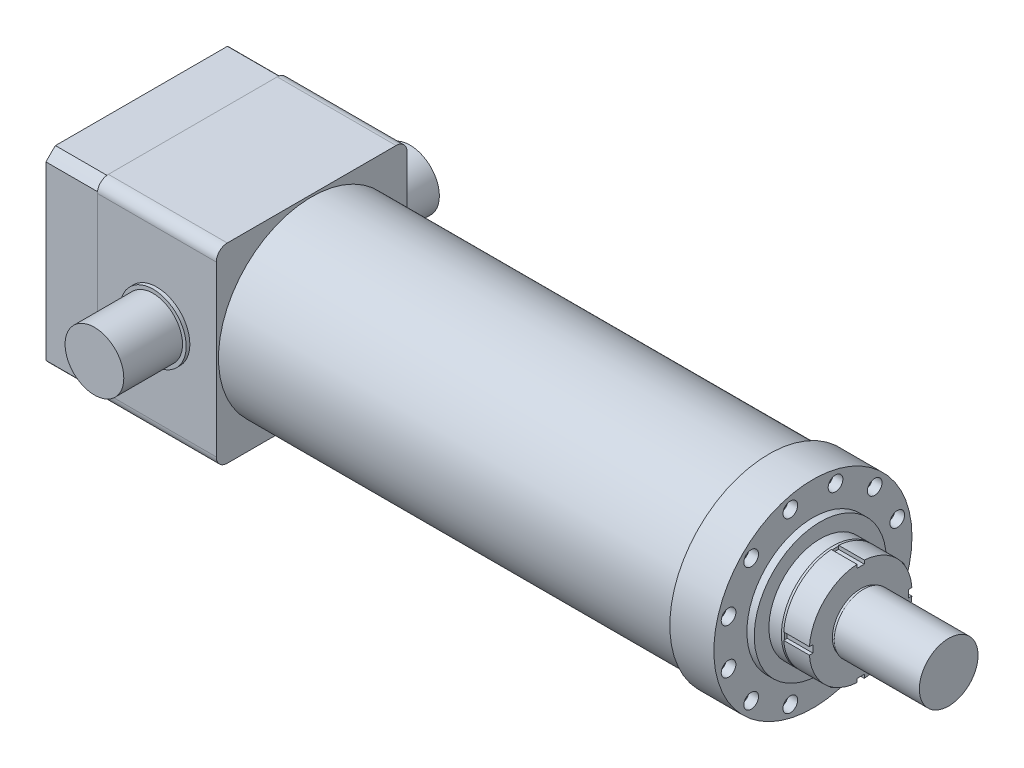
from build123d import *

# Parameters (mm, degrees)
SKETCH_1_R                = 127
SKETCH_1_R_2              = 110
EXTRUDE_1_DEPTH           = 623
SKETCH_2_R                = 135
SKETCH_2_R_2              = 6.5
EXTRUDE_2_DEPTH           = 60
SKETCH_3_R                = 90
EXTRUDE_3_DEPTH           = 10
SKETCH_5_R                = 70
EXTRUDE_4_DEPTH           = 20
CHAMFER_1_SIZE            = 3
CHAMFER_1_SIZE2           = 1.091910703
SKETCH_7_R                = 70
EXTRUDE_5_DEPTH           = 35
SKETCH_8_R                = 38.5
EXTRUDE_6_DEPTH           = 4
SKETCH_9_R                = 40
EXTRUDE_7_DEPTH           = 116
SKETCH_10_W               = 10
SKETCH_10_H               = 12.219318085
SKETCH_10_W_2             = 33.965202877
SKETCH_10_H_2             = 10
SKETCH_10_H_3             = 35.687535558
CUT_EXTRUDE_2_DEPTH       = 35
EXTRUDE_8_DEPTH           = 162
EXTRUDE_10_DEPTH          = 70
SKETCH_16_R               = 80
CUT_EXTRUDE_4_DEPTH       = 26
SKETCH_17_R               = 81.5
CUT_EXTRUDE_5_DEPTH       = 38
SKETCH_22_W               = 10
SKETCH_22_H               = 13
HOLE_WIZARD_1_AT_2_COUNT  = 2
HOLE_WIZARD_1_AT_2_PITCH  = 61.598932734
HOLE_WIZARD_1_AT_3_COUNT  = 2
HOLE_WIZARD_1_AT_3_PITCH  = 119
HOLE_WIZARD_1_AT_4_COUNT  = 2
HOLE_WIZARD_1_AT_4_PITCH  = 168.291413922
HOLE_WIZARD_1_AT_5_COUNT  = 2
HOLE_WIZARD_1_AT_5_PITCH  = 206.114046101
HOLE_WIZARD_1_AT_6_COUNT  = 2
HOLE_WIZARD_1_AT_6_PITCH  = 229.890346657
HOLE_WIZARD_1_AT_7_COUNT  = 2
HOLE_WIZARD_1_AT_7_PITCH  = 238
HOLE_WIZARD_1_AT_8_COUNT  = 2
HOLE_WIZARD_1_AT_8_PITCH  = 229.890346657
HOLE_WIZARD_1_AT_9_COUNT  = 2
HOLE_WIZARD_1_AT_9_PITCH  = 206.114046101
HOLE_WIZARD_1_AT_10_COUNT = 2
HOLE_WIZARD_1_AT_10_PITCH = 168.291413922
HOLE_WIZARD_1_AT_11_COUNT = 2
HOLE_WIZARD_1_AT_11_PITCH = 119
HOLE_WIZARD_1_AT_12_COUNT = 2
HOLE_WIZARD_1_AT_12_PITCH = 61.598932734
SKETCH_24_R               = 40
EXTRUDE_11_DEPTH          = 85
EXTRUDE_START             = -260
SKETCH_24_2_R             = 40
EXTRUDE_12_DEPTH          = 85
SKETCH_25_R               = 45
SKETCH_25_R_2             = 40
EXTRUDE_13_DEPTH          = 5
SKETCH_25_2_R             = 45
SKETCH_25_2_R_2           = 40
EXTRUDE_14_DEPTH          = 5


with BuildPart() as part:
    # Sketch 1 → Extrude 1 (new body)
    with BuildSketch(Plane(origin=(0, 0, 0), x_dir=(0, 0, -1), z_dir=(1, 0, 0))):
        Circle(SKETCH_1_R)
        Circle(SKETCH_1_R_2, mode=Mode.SUBTRACT)
    extrude(amount=EXTRUDE_1_DEPTH)


with BuildPart() as body_2:
    # Sketch 2 → Extrude 2 (new body)
    with BuildSketch(Plane(origin=(623, 0, 0), x_dir=(0, 0, -1), z_dir=(1, 0, 0))):
        Circle(SKETCH_2_R)
        with Locations((30.799466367, 114.945173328)):
            Circle(SKETCH_2_R_2, mode=Mode.SUBTRACT)
        with Locations((84.145706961, 84.145706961)):
            Circle(SKETCH_2_R_2, mode=Mode.SUBTRACT)
        with Locations((114.945173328, 30.799466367)):
            Circle(SKETCH_2_R_2, mode=Mode.SUBTRACT)
        with Locations((114.945173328, -30.799466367)):
            Circle(SKETCH_2_R_2, mode=Mode.SUBTRACT)
        with Locations((84.145706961, -84.145706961)):
            Circle(SKETCH_2_R_2, mode=Mode.SUBTRACT)
        with Locations((30.799466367, -114.945173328)):
            Circle(SKETCH_2_R_2, mode=Mode.SUBTRACT)
        with Locations((-30.799466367, -114.945173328)):
            Circle(SKETCH_2_R_2, mode=Mode.SUBTRACT)
        with Locations((-84.145706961, -84.145706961)):
            Circle(SKETCH_2_R_2, mode=Mode.SUBTRACT)
        with Locations((-114.945173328, -30.799466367)):
            Circle(SKETCH_2_R_2, mode=Mode.SUBTRACT)
        with Locations((-114.945173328, 30.799466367)):
            Circle(SKETCH_2_R_2, mode=Mode.SUBTRACT)
        with Locations((-84.145706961, 84.145706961)):
            Circle(SKETCH_2_R_2, mode=Mode.SUBTRACT)
        with Locations((-30.799466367, 114.945173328)):
            Circle(SKETCH_2_R_2, mode=Mode.SUBTRACT)
    extrude(amount=EXTRUDE_2_DEPTH)

    # Sketch 3 → Extrude 3 (add)
    with BuildSketch(Plane(origin=(683, 0, 0), x_dir=(0, 0, -1), z_dir=(1, 0, 0))):
        Circle(SKETCH_3_R)
    extrude(amount=EXTRUDE_3_DEPTH)

    # Sketch 5 → Extrude 4 (add)
    with BuildSketch(Plane(origin=(693, 0, 0), x_dir=(0, 0, -1), z_dir=(1, 0, 0))):
        Circle(SKETCH_5_R)
    extrude(amount=EXTRUDE_4_DEPTH)

    # Chamfer 1
    chamfer_1_edges = [body_2.edges().sort_by_distance(p)[0] for p in [
        (713, 0, 70),
    ]]
    chamfer_1_side = [body_2.faces().sort_by_distance(p)[0] for p in [
        (703, 0, 70),
    ]]
    chamfer(chamfer_1_edges, length=CHAMFER_1_SIZE, length2=CHAMFER_1_SIZE2, reference=chamfer_1_side[0])

    # Sketch 7 → Extrude 5 (add)
    with BuildSketch(Plane(origin=(713, 0, 0), x_dir=(0, 0, -1), z_dir=(1, 0, 0))):
        Circle(SKETCH_7_R)
    extrude(amount=EXTRUDE_5_DEPTH)

    # Sketch 8 → Extrude 6 (add)
    with BuildSketch(Plane(origin=(748, 0, 0), x_dir=(0, 0, -1), z_dir=(1, 0, 0))):
        Circle(SKETCH_8_R)
    extrude(amount=EXTRUDE_6_DEPTH)

    # Sketch 9 → Extrude 7 (add)
    with BuildSketch(Plane(origin=(752, 0, 0), x_dir=(0, 0, -1), z_dir=(1, 0, 0))):
        with Locations(Location((0, 0, 0), (0, 0, 180))):
            Circle(SKETCH_9_R)
    extrude(amount=EXTRUDE_7_DEPTH)

    # Sketch 10 → Cut-Extrude 2 (cut)
    with BuildSketch(Plane(origin=(748, 0, 0), x_dir=(0, 0, -1), z_dir=(1, 0, 0))):
        with Locations((0, -71.109659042)):
            Rectangle(SKETCH_10_W, SKETCH_10_H)
        Polygon((-76.465931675, 5), (-65, 5), (-65, -5), (-79.460488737, -5), align=None)
        with Locations((81.982601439, 0)):
            Rectangle(SKETCH_10_W_2, SKETCH_10_H_2)
        with Locations((0, 82.843767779)):
            Rectangle(SKETCH_10_W, SKETCH_10_H_3)
    extrude(amount=-CUT_EXTRUDE_2_DEPTH, mode=Mode.SUBTRACT)

    # Sketch 22 → Hole Wizard 1 (revolve, cut)
    with BuildSketch(Plane(origin=(683, 84.145706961, 84.145706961), x_dir=(0, 0, -1), z_dir=(0, 1, 0))):
        with Locations((5, 6.5)):
            Rectangle(SKETCH_22_W, SKETCH_22_H)
    hole_wizard_1 = revolve(axis=Axis((573, 84.145706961, 84.145706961), (1, 0, 0)), mode=Mode.SUBTRACT)

    # Hole Wizard 1 at 2: Hole Wizard 1 ×2
    with Locations(*[Vector(0, 0.5000000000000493, -0.8660254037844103) * (i * HOLE_WIZARD_1_AT_2_PITCH) for i in range(1, HOLE_WIZARD_1_AT_2_COUNT)]):
        add(hole_wizard_1, mode=Mode.SUBTRACT)

    # Hole Wizard 1 at 3: Hole Wizard 1 ×2
    with Locations(*[Vector(0, 0.2588190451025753, -0.9659258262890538) * (i * HOLE_WIZARD_1_AT_3_PITCH) for i in range(1, HOLE_WIZARD_1_AT_3_COUNT)]):
        add(hole_wizard_1, mode=Mode.SUBTRACT)

    # Hole Wizard 1 at 4: Hole Wizard 1 ×2
    with Locations(*[(0, 0, -i * HOLE_WIZARD_1_AT_4_PITCH) for i in range(1, HOLE_WIZARD_1_AT_4_COUNT)]):
        add(hole_wizard_1, mode=Mode.SUBTRACT)

    # Hole Wizard 1 at 5: Hole Wizard 1 ×2
    with Locations(*[Vector(0, -0.2588190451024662, -0.965925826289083) * (i * HOLE_WIZARD_1_AT_5_PITCH) for i in range(1, HOLE_WIZARD_1_AT_5_COUNT)]):
        add(hole_wizard_1, mode=Mode.SUBTRACT)

    # Hole Wizard 1 at 6: Hole Wizard 1 ×2
    with Locations(*[Vector(0, -0.49999999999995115, -0.8660254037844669) * (i * HOLE_WIZARD_1_AT_6_PITCH) for i in range(1, HOLE_WIZARD_1_AT_6_COUNT)]):
        add(hole_wizard_1, mode=Mode.SUBTRACT)

    # Hole Wizard 1 at 7: Hole Wizard 1 ×2
    with Locations(*[Vector(0, -0.7071067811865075, -0.7071067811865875) * (i * HOLE_WIZARD_1_AT_7_PITCH) for i in range(1, HOLE_WIZARD_1_AT_7_COUNT)]):
        add(hole_wizard_1, mode=Mode.SUBTRACT)

    # Hole Wizard 1 at 8: Hole Wizard 1 ×2
    with Locations(*[Vector(0, -0.8660254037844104, -0.5000000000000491) * (i * HOLE_WIZARD_1_AT_8_PITCH) for i in range(1, HOLE_WIZARD_1_AT_8_COUNT)]):
        add(hole_wizard_1, mode=Mode.SUBTRACT)

    # Hole Wizard 1 at 9: Hole Wizard 1 ×2
    with Locations(*[Vector(0, -0.9659258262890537, -0.2588190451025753) * (i * HOLE_WIZARD_1_AT_9_PITCH) for i in range(1, HOLE_WIZARD_1_AT_9_COUNT)]):
        add(hole_wizard_1, mode=Mode.SUBTRACT)

    # Hole Wizard 1 at 10: Hole Wizard 1 ×2
    with Locations(*[(0, -i * HOLE_WIZARD_1_AT_10_PITCH, 0) for i in range(1, HOLE_WIZARD_1_AT_10_COUNT)]):
        add(hole_wizard_1, mode=Mode.SUBTRACT)

    # Hole Wizard 1 at 11: Hole Wizard 1 ×2
    with Locations(*[Vector(0, -0.9659258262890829, 0.2588190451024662) * (i * HOLE_WIZARD_1_AT_11_PITCH) for i in range(1, HOLE_WIZARD_1_AT_11_COUNT)]):
        add(hole_wizard_1, mode=Mode.SUBTRACT)

    # Hole Wizard 1 at 12: Hole Wizard 1 ×2
    with Locations(*[Vector(0, -0.8660254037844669, 0.4999999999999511) * (i * HOLE_WIZARD_1_AT_12_PITCH) for i in range(1, HOLE_WIZARD_1_AT_12_COUNT)]):
        add(hole_wizard_1, mode=Mode.SUBTRACT)


with BuildPart() as body_3:
    # Sketch 11 → Extrude 8 (new body)
    with BuildSketch(Plane.ZY):
        with BuildLine():
            Line((-115, 130), (115, 130))
            ThreePointArc((115, 130), (125.606601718, 125.606601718), (130, 115))
            Line((130, 115), (130, -115))
            ThreePointArc((130, -115), (125.606601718, -125.606601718), (115, -130))
            Line((115, -130), (-115, -130))
            ThreePointArc((-115, -130), (-125.606601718, -125.606601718), (-130, -115))
            Line((-130, -115), (-130, 115))
            ThreePointArc((-130, 115), (-125.606601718, 125.606601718), (-115, 130))
        make_face()
    extrude(amount=EXTRUDE_8_DEPTH)

    # Sketch 24 → Extrude 11 (add)
    with BuildSketch(Plane.XY.offset(130)):
        with Locations(Location((-81, 0, 0), (0, 0, 90))):
            Circle(SKETCH_24_R)
    extrude(amount=EXTRUDE_11_DEPTH)

    # Sketch 24_2 → Extrude 12 (add)
    with BuildSketch(Plane.XY.offset(130).offset(EXTRUDE_START)):
        with Locations(Location((-81, 0, 0), (0, 0, 90))):
            Circle(SKETCH_24_2_R)
    extrude(amount=-EXTRUDE_12_DEPTH)

    # Sketch 25 → Extrude 13 (add)
    with BuildSketch(Plane.XY.offset(130)):
        with Locations(Location((-81, 0, 0), (0, 0, 90))):
            Circle(SKETCH_25_R)
        with Locations((-81, 0)):
            Circle(SKETCH_25_R_2, mode=Mode.SUBTRACT)
    extrude(amount=EXTRUDE_13_DEPTH)

    # Sketch 25_2 → Extrude 14 (add)
    with BuildSketch(Plane.XY.offset(130).offset(EXTRUDE_START)):
        with Locations(Location((-81, 0, 0), (0, 0, 90))):
            Circle(SKETCH_25_2_R)
        with Locations((-81, 0)):
            Circle(SKETCH_25_2_R_2, mode=Mode.SUBTRACT)
    extrude(amount=-EXTRUDE_14_DEPTH)


with BuildPart() as body_4:
    # Sketch 15 → Extrude 10 (new body)
    with BuildSketch(Plane.ZY.offset(162)):
        with BuildLine():
            Line((-117.153745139, 130), (117.153745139, 130))
            ThreePointArc((117.153745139, 130), (123.743686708, 123.743686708), (130, 117.153745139))
            Line((130, 117.153745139), (130, -117.153745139))
            ThreePointArc((130, -117.153745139), (123.743686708, -123.743686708), (117.153745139, -130))
            Line((117.153745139, -130), (-117.153745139, -130))
            ThreePointArc((-117.153745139, -130), (-123.743686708, -123.743686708), (-130, -117.153745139))
            Line((-130, -117.153745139), (-130, 117.153745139))
            ThreePointArc((-130, 117.153745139), (-123.743686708, 123.743686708), (-117.153745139, 130))
        make_face()
    extrude(amount=EXTRUDE_10_DEPTH)

    # Sketch 16 → Cut-Extrude 4 (cut)
    with BuildSketch(Plane.ZY.offset(232)):
        Circle(SKETCH_16_R)
    extrude(amount=-CUT_EXTRUDE_4_DEPTH, mode=Mode.SUBTRACT)

    # Sketch 17 → Cut-Extrude 5 (cut)
    with BuildSketch(Plane.ZY.offset(206)):
        Circle(SKETCH_17_R)
    extrude(amount=-CUT_EXTRUDE_5_DEPTH, mode=Mode.SUBTRACT)


solid = Compound([part.part, body_2.part, body_3.part, body_4.part])
